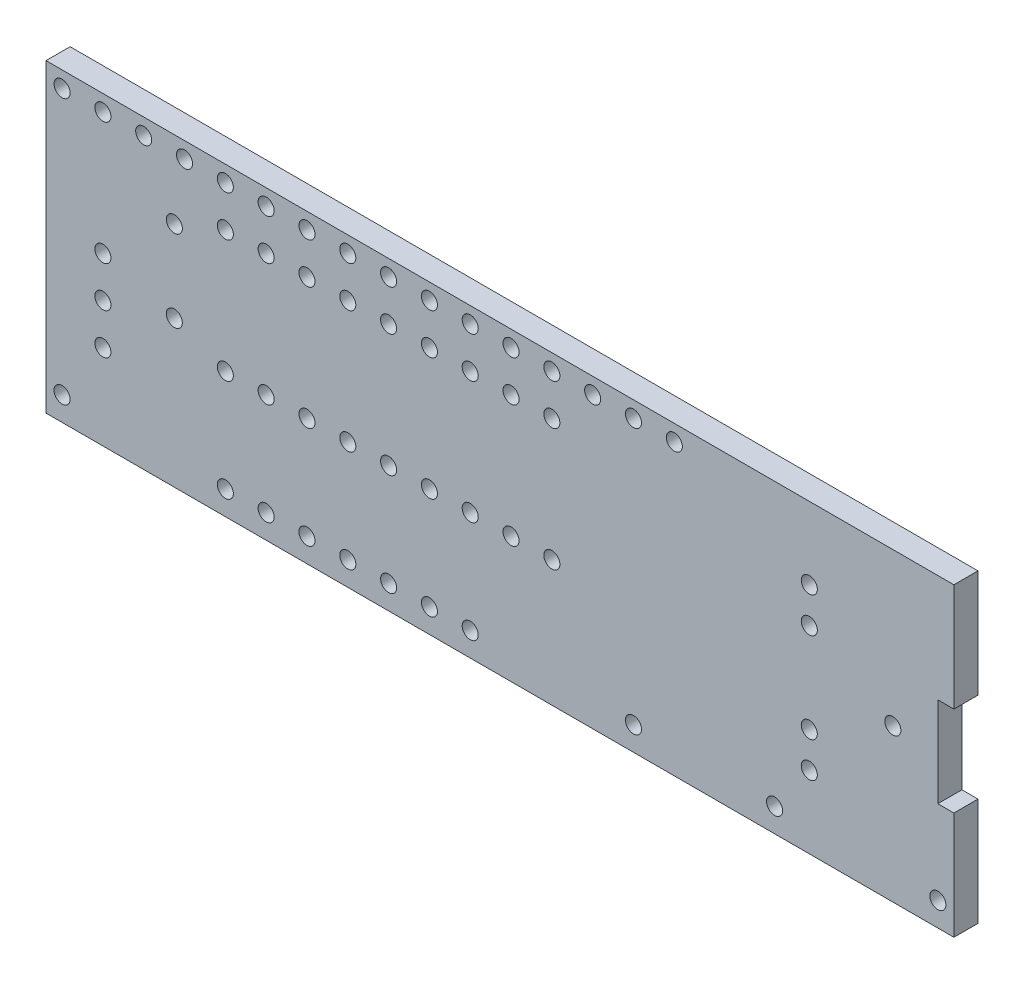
from build123d import *

# Parameters (mm, degrees)
ESQUISSE1_R        = 0.5
BOSS_EXTRU_1_DEPTH = 1.5


with BuildPart() as part:
    # Esquisse1 → Boss.-Extru.1 (new body)
    with BuildSketch(Plane.XY):
        Polygon((0, 0), (56.5, 0), (56.5, 6.7), (55.5, 6.7), (55.5, 12.3), (56.5, 12.3), (56.5, 19), (0, 19), align=None)
        with Locations((1, 18)):
            Circle(ESQUISSE1_R, mode=Mode.SUBTRACT)
        with Locations((3.54, 18)):
            Circle(ESQUISSE1_R, mode=Mode.SUBTRACT)
        with Locations((6.08, 18)):
            Circle(ESQUISSE1_R, mode=Mode.SUBTRACT)
        with Locations((8.62, 18)):
            Circle(ESQUISSE1_R, mode=Mode.SUBTRACT)
        with Locations((11.16, 18)):
            Circle(ESQUISSE1_R, mode=Mode.SUBTRACT)
        with Locations((13.7, 18)):
            Circle(ESQUISSE1_R, mode=Mode.SUBTRACT)
        with Locations((16.24, 18)):
            Circle(ESQUISSE1_R, mode=Mode.SUBTRACT)
        with Locations((18.78, 18)):
            Circle(ESQUISSE1_R, mode=Mode.SUBTRACT)
        with Locations((21.32, 18)):
            Circle(ESQUISSE1_R, mode=Mode.SUBTRACT)
        with Locations((23.86, 18)):
            Circle(ESQUISSE1_R, mode=Mode.SUBTRACT)
        with Locations((26.4, 18)):
            Circle(ESQUISSE1_R, mode=Mode.SUBTRACT)
        with Locations((28.94, 18)):
            Circle(ESQUISSE1_R, mode=Mode.SUBTRACT)
        with Locations((31.48, 18)):
            Circle(ESQUISSE1_R, mode=Mode.SUBTRACT)
        with Locations((34.02, 18)):
            Circle(ESQUISSE1_R, mode=Mode.SUBTRACT)
        with Locations((36.56, 18)):
            Circle(ESQUISSE1_R, mode=Mode.SUBTRACT)
        with Locations((39.1, 18)):
            Circle(ESQUISSE1_R, mode=Mode.SUBTRACT)
        with Locations((31.48, 15.46)):
            Circle(ESQUISSE1_R, mode=Mode.SUBTRACT)
        with Locations((28.94, 15.46)):
            Circle(ESQUISSE1_R, mode=Mode.SUBTRACT)
        with Locations((26.4, 15.46)):
            Circle(ESQUISSE1_R, mode=Mode.SUBTRACT)
        with Locations((23.86, 15.46)):
            Circle(ESQUISSE1_R, mode=Mode.SUBTRACT)
        with Locations((21.32, 15.46)):
            Circle(ESQUISSE1_R, mode=Mode.SUBTRACT)
        with Locations((18.78, 15.46)):
            Circle(ESQUISSE1_R, mode=Mode.SUBTRACT)
        with Locations((16.24, 15.46)):
            Circle(ESQUISSE1_R, mode=Mode.SUBTRACT)
        with Locations((13.7, 15.46)):
            Circle(ESQUISSE1_R, mode=Mode.SUBTRACT)
        with Locations((11.16, 15.46)):
            Circle(ESQUISSE1_R, mode=Mode.SUBTRACT)
        with Locations((31.48, 7.84)):
            Circle(ESQUISSE1_R, mode=Mode.SUBTRACT)
        with Locations((28.94, 7.84)):
            Circle(ESQUISSE1_R, mode=Mode.SUBTRACT)
        with Locations((26.4, 7.84)):
            Circle(ESQUISSE1_R, mode=Mode.SUBTRACT)
        with Locations((23.86, 7.84)):
            Circle(ESQUISSE1_R, mode=Mode.SUBTRACT)
        with Locations((21.32, 7.84)):
            Circle(ESQUISSE1_R, mode=Mode.SUBTRACT)
        with Locations((18.78, 7.84)):
            Circle(ESQUISSE1_R, mode=Mode.SUBTRACT)
        with Locations((16.24, 7.84)):
            Circle(ESQUISSE1_R, mode=Mode.SUBTRACT)
        with Locations((13.7, 7.84)):
            Circle(ESQUISSE1_R, mode=Mode.SUBTRACT)
        with Locations((11.16, 7.84)):
            Circle(ESQUISSE1_R, mode=Mode.SUBTRACT)
        with Locations((23.86, 1.49)):
            Circle(ESQUISSE1_R, mode=Mode.SUBTRACT)
        with Locations((21.32, 1.49)):
            Circle(ESQUISSE1_R, mode=Mode.SUBTRACT)
        with Locations((18.78, 1.49)):
            Circle(ESQUISSE1_R, mode=Mode.SUBTRACT)
        with Locations((16.24, 1.49)):
            Circle(ESQUISSE1_R, mode=Mode.SUBTRACT)
        with Locations((13.7, 1.49)):
            Circle(ESQUISSE1_R, mode=Mode.SUBTRACT)
        with Locations((11.16, 1.49)):
            Circle(ESQUISSE1_R, mode=Mode.SUBTRACT)
        with Locations((26.4, 1.49)):
            Circle(ESQUISSE1_R, mode=Mode.SUBTRACT)
        with Locations((36.56, 1.49)):
            Circle(ESQUISSE1_R, mode=Mode.SUBTRACT)
        with Locations((1, 1.49)):
            Circle(ESQUISSE1_R, mode=Mode.SUBTRACT)
        with Locations(Location((55.5, 1.49, 0), (0, 0, 180))):
            Circle(ESQUISSE1_R, mode=Mode.SUBTRACT)
        with Locations(Location((45.34, 1.49, 0), (0, 0, 180))):
            Circle(ESQUISSE1_R, mode=Mode.SUBTRACT)
        with Locations((3.54, 5.3)):
            Circle(ESQUISSE1_R, mode=Mode.SUBTRACT)
        with Locations((3.54, 7.84)):
            Circle(ESQUISSE1_R, mode=Mode.SUBTRACT)
        with Locations((3.54, 10.38)):
            Circle(ESQUISSE1_R, mode=Mode.SUBTRACT)
        with Locations((52.7, 9.5)):
            Circle(ESQUISSE1_R, mode=Mode.SUBTRACT)
        with Locations((47.5, 14.5)):
            Circle(ESQUISSE1_R, mode=Mode.SUBTRACT)
        with Locations((47.5, 12.3)):
            Circle(ESQUISSE1_R, mode=Mode.SUBTRACT)
        with Locations(Location((47.5, 4.5, 0), (0, 0, 180))):
            Circle(ESQUISSE1_R, mode=Mode.SUBTRACT)
        with Locations(Location((47.5, 6.7, 0), (0, 0, 180))):
            Circle(ESQUISSE1_R, mode=Mode.SUBTRACT)
        with Locations((7.985, 14.19)):
            Circle(ESQUISSE1_R, mode=Mode.SUBTRACT)
        with Locations((7.985, 9.11)):
            Circle(ESQUISSE1_R, mode=Mode.SUBTRACT)
    extrude(amount=BOSS_EXTRU_1_DEPTH)


solid = part.part
